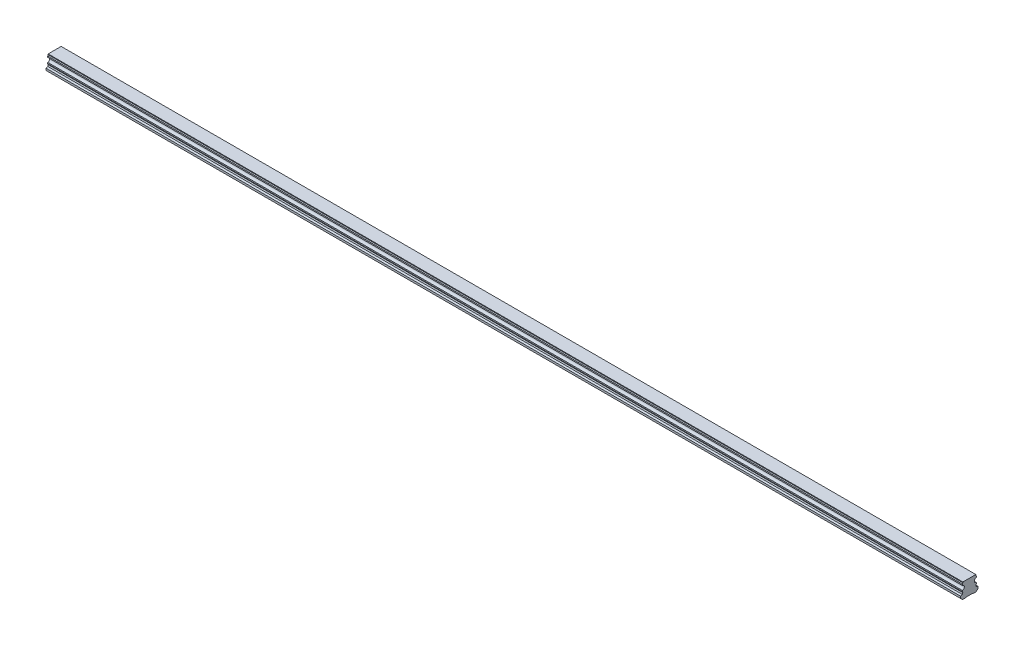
from build123d import *

# Parameters (mm, degrees)
BOSS_EXTRUDE1_DEPTH        = 1320
SKETCH3_R                  = 3
SKETCH3_R_2                = 2.5
CUT_EXTRUDE3_DEPTH         = 12
SKETCH3_2_R                = 2.5
CUT_EXTRUDE4_DEPTH         = 15
CHAMFER1_SIZE              = 0.5
LPATTERN4_COUNT            = 22
LPATTERN4_PITCH            = 60
CHAMFER1_OF_LPATTERN4_SIZE = 0.5


with BuildPart() as part:
    # Sketch1 → Boss-Extrude1 (new body)
    with BuildSketch(Plane(origin=(0, 0, 0), x_dir=(0, 0, -1), z_dir=(1, 0, 0))):
        with BuildLine():
            Line((9.375, 21.8), (-9.375, 21.8))
            Line((-9.375, 21.8), (-9.375, 20.756))
            Line((-9.375, 20.756), (-10, 19.415683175))
            Line((-10, 19.415683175), (-10, 17.685449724))
            ThreePointArc((-10, 17.685449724), (-7.2, 14.6), (-10, 11.514550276))
            Line((-10, 11.514550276), (-10, 9.784316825))
            Line((-10, 9.784316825), (-9.375, 8.444))
            Line((-9.375, 8.444), (-9.922688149, 6.4))
            Line((-9.922688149, 6.4), (-12.5, 5.489338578))
            Line((-12.5, 5.489338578), (-12.5, 2.65))
            Line((-12.5, 2.65), (-9.85, 0))
            Line((-9.85, 0), (-5.5, 0))
            Line((-5.5, 0), (-5, 0.5))
            Line((-5, 0.5), (5, 0.5))
            Line((5, 0.5), (5.5, 0))
            Line((5.5, 0), (9.85, 0))
            Line((9.85, 0), (12.5, 2.65))
            Line((12.5, 2.65), (12.5, 5.489338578))
            Line((12.5, 5.489338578), (9.922688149, 6.4))
            Line((9.922688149, 6.4), (9.375, 8.444))
            Line((9.375, 8.444), (10, 9.784316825))
            Line((10, 9.784316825), (10, 11.514550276))
            ThreePointArc((10, 11.514550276), (7.2, 14.6), (10, 17.685449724))
            Line((10, 17.685449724), (10, 19.415683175))
            Line((10, 19.415683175), (9.375, 20.756))
            Line((9.375, 20.756), (9.375, 21.8))
        make_face()
    extrude(amount=BOSS_EXTRUDE1_DEPTH)

    # Sketch3 → Cut-Extrude3 (cut)
    with BuildSketch(Plane.XZ):
        with Locations(Location((30, 0, 0), (0, 0, 270))):
            Circle(SKETCH3_R)
        with Locations(Location((30, 0, 0), (0, 0, 270))):
            Circle(SKETCH3_R_2, mode=Mode.SUBTRACT)
    cut_extrude3 = extrude(amount=-CUT_EXTRUDE3_DEPTH, mode=Mode.SUBTRACT)

    # Sketch3_2 → Cut-Extrude4 (cut)
    with BuildSketch(Plane.XZ):
        with Locations(Location((30, 0, 0), (0, 0, 270))):
            Circle(SKETCH3_2_R)
    cut_extrude4 = extrude(amount=-CUT_EXTRUDE4_DEPTH, mode=Mode.SUBTRACT)

    # Cut-Extrude5 cone 1 section (on through the dimple's axis) → Cut-Extrude5 (revolve, cut)
    with BuildSketch(Plane(origin=(30, 15, 0), x_dir=(0, 0, -1), z_dir=(1, 0, 0))):
        Polygon((0, 0), (2.5, 0), (0, 1.443375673), align=None)
    cut_extrude5 = revolve(axis=Axis((30, 15, 0), (0, 1, 0)), mode=Mode.SUBTRACT)

    # Chamfer1
    chamfer1_edges = [part.edges().sort_by_distance(p)[0] for p in [
        (30, 0.5, 3),
    ]]
    chamfer(chamfer1_edges, length=CHAMFER1_SIZE)

    # LPattern4: Cut-Extrude3, Cut-Extrude4, Cut-Extrude5 ×22
    with Locations(*[(i * LPATTERN4_PITCH, 0, 0) for i in range(1, LPATTERN4_COUNT)]):
        add(cut_extrude3, mode=Mode.SUBTRACT)
        add(cut_extrude4, mode=Mode.SUBTRACT)
        add(cut_extrude5, mode=Mode.SUBTRACT)

    # Chamfer1 of LPattern4
    chamfer1_of_lpattern4_edges = [part.edges().sort_by_distance(p)[0] for p in [
        (90, 0.5, 3),
        (150, 0.5, 3),
        (210, 0.5, 3),
        (270, 0.5, 3),
        (330, 0.5, 3),
        (390, 0.5, 3),
        (450, 0.5, 3),
        (510, 0.5, 3),
        (570, 0.5, 3),
        (630, 0.5, 3),
        (690, 0.5, 3),
        (750, 0.5, 3),
        (810, 0.5, 3),
        (870, 0.5, 3),
        (930, 0.5, 3),
        (990, 0.5, 3),
        (1050, 0.5, 3),
        (1110, 0.5, 3),
        (1170, 0.5, 3),
        (1230, 0.5, 3),
        (1290, 0.5, 3),
    ]]
    chamfer(chamfer1_of_lpattern4_edges, length=CHAMFER1_OF_LPATTERN4_SIZE)


solid = part.part
